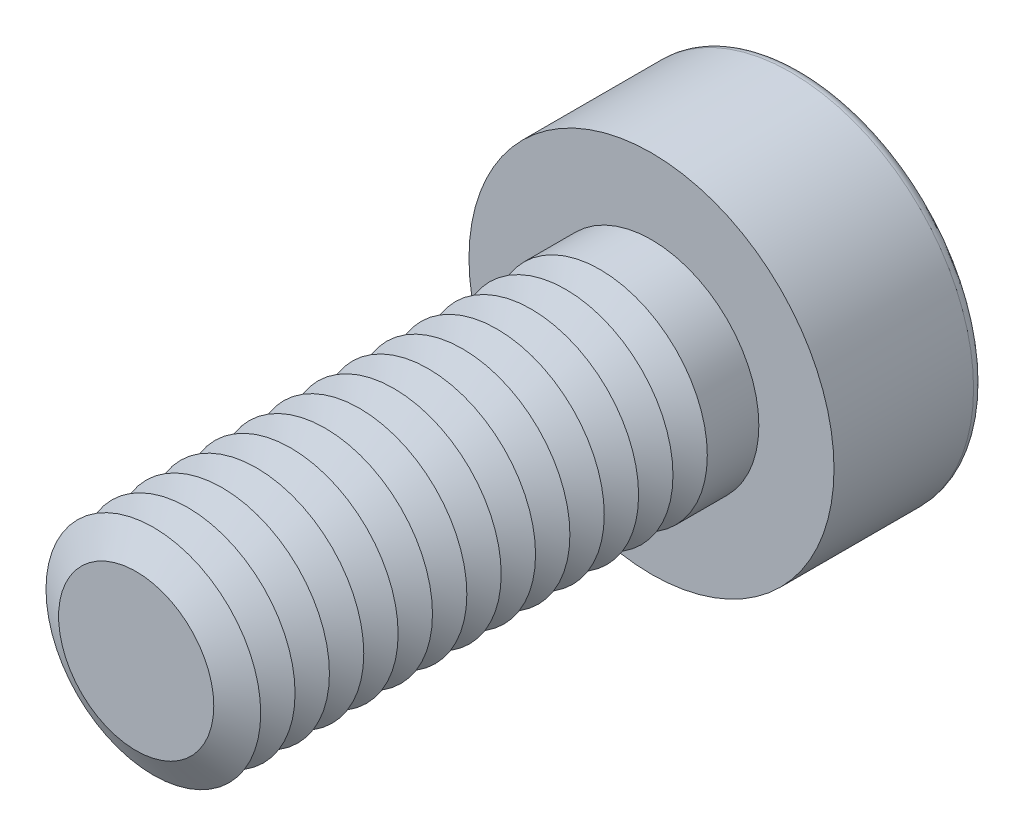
from build123d import *

# Parameters (mm, degrees)
SKETCH1_R           = 2.5
BOSS_EXTRUDE1_DEPTH = 12
SKETCH2_R           = 4.25
BOSS_EXTRUDE2_DEPTH = 3.5
CUT_EXTRUDE1_DEPTH  = 2.25
FILLET1_R           = 0.25
LPATTERN1_COUNT     = 14
LPATTERN1_PITCH     = 0.8


with BuildPart() as part:
    # Sketch1 → Boss-Extrude1 (new body)
    with BuildSketch(Plane.XY):
        Circle(SKETCH1_R)
    extrude(amount=BOSS_EXTRUDE1_DEPTH)

    # Sketch2 → Boss-Extrude2 (add)
    with BuildSketch(Plane(origin=(0, 0, 0), x_dir=(-1, 0, 0), z_dir=(0, 0, -1))):
        Circle(SKETCH2_R)
    extrude(amount=BOSS_EXTRUDE2_DEPTH)

    # Sketch3 → Cut-Extrude1 (cut)
    with BuildSketch(Plane(origin=(0, 0, -3.5), x_dir=(-1, 0, 0), z_dir=(0, 0, -1))):
        Polygon((-0.866025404, 1.5), (-1.732050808, 0), (-0.866025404, -1.5), (0.866025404, -1.5), (1.732050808, 0), (0.866025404, 1.5), align=None)
    extrude(amount=-CUT_EXTRUDE1_DEPTH, mode=Mode.SUBTRACT)

    # Fillet1
    fillet1_edges = [part.edges().sort_by_distance(p)[0] for p in [
        (4.25, 0, -3.5),
    ]]
    fillet(fillet1_edges, radius=FILLET1_R)

    # Cut-Extrude2 cone 1 section (on through the dimple's axis) → Cut-Extrude2 (revolve, cut)
    with BuildSketch(Plane(origin=(0, 0, -1.25), x_dir=(0, 1, 0), z_dir=(1, 0, 0))):
        Polygon((0, 0), (1.5, 0), (0, 0.866025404), align=None)
    revolve(axis=Axis((0, 0, -1.25), (0, 0, 1)), mode=Mode.SUBTRACT)

    # Cut-Extrude3 cone 1 section (on through the dimple's axis) → Cut-Extrude3 (revolve, cut)
    with BuildSketch(Plane(origin=(0, 0, -3.5), x_dir=(0, 1, 0), z_dir=(1, 0, 0))):
        Polygon((0, 0), (1.732050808, 0), (0, 0.464101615), align=None)
    revolve(axis=Axis((0, 0, -3.5), (0, 0, 1)), mode=Mode.SUBTRACT)

    # Sketch7 → Cut-Revolve1 (revolve, cut)
    with BuildSketch(Plane(origin=(0, 0, 0), x_dir=(0, 0, -1), z_dir=(1, 0, 0)), mode=Mode.PRIVATE) as cut_revolve1_sk:
        Polygon((-12, 1.807179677), (-11.6, 2.5), (-12.4, 2.5), align=None)
    cut_revolve1 = revolve(cut_revolve1_sk.sketch.rotate(Axis((0, 0, 12), (0, 0, -1)), 90), axis=Axis((0, 0, 12), (0, 0, -1)), mode=Mode.SUBTRACT)

    # LPattern1: Cut-Revolve1 ×14
    with Locations(*[(0, 0, -i * LPATTERN1_PITCH) for i in range(1, LPATTERN1_COUNT)]):
        add(cut_revolve1, mode=Mode.SUBTRACT)


solid = part.part
